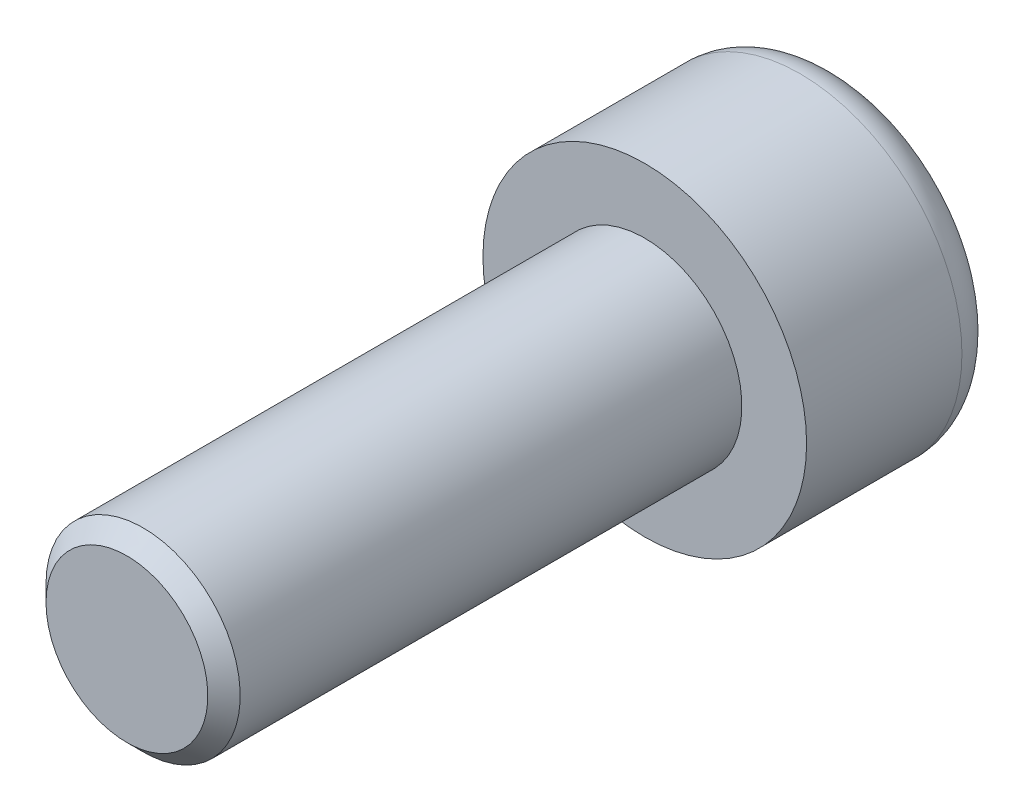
ISO-10303-21;
HEADER;
FILE_DESCRIPTION(('STEP AP214'),'2;1');
FILE_NAME('part.step','',(''),(''),'','','');
FILE_SCHEMA(('AUTOMOTIVE_DESIGN { 1 0 10303 214 1 1 1 1 }'));
ENDSEC;
DATA;
#1=APPLICATION_CONTEXT('core data for automotive mechanical design processes');
#2=APPLICATION_PROTOCOL_DEFINITION('international standard','automotive_design',2000,#1);
#3=PRODUCT_CONTEXT('',#1,'mechanical');
#4=PRODUCT('Part','Part','',(#3));
#5=PRODUCT_RELATED_PRODUCT_CATEGORY('part','',(#4));
#6=PRODUCT_DEFINITION_FORMATION('','',#4);
#7=PRODUCT_DEFINITION_CONTEXT('part definition',#1,'design');
#8=PRODUCT_DEFINITION('design','',#6,#7);
#9=PRODUCT_DEFINITION_SHAPE('','',#8);
#10=(LENGTH_UNIT() NAMED_UNIT(*) SI_UNIT(.MILLI.,.METRE.));
#11=(NAMED_UNIT(*) PLANE_ANGLE_UNIT() SI_UNIT($,.RADIAN.));
#12=(NAMED_UNIT(*) SI_UNIT($,.STERADIAN.) SOLID_ANGLE_UNIT());
#13=UNCERTAINTY_MEASURE_WITH_UNIT(LENGTH_MEASURE(1.E-05),#10,'distance_accuracy_value','');
#14=(GEOMETRIC_REPRESENTATION_CONTEXT(3) GLOBAL_UNCERTAINTY_ASSIGNED_CONTEXT((#13)) GLOBAL_UNIT_ASSIGNED_CONTEXT((#10,
#11,#12)) REPRESENTATION_CONTEXT('',''));
#15=CARTESIAN_POINT('',(0.,0.,0.));
#16=DIRECTION('',(0.,0.,1.));
#17=DIRECTION('',(1.,0.,0.));
#18=AXIS2_PLACEMENT_3D('',#15,#16,#17);
#19=CARTESIAN_POINT('',(-4.99999999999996,0.,3.75));
#20=DIRECTION('',(0.,0.,1.));
#21=DIRECTION('',(1.,0.,0.));
#22=AXIS2_PLACEMENT_3D('',#19,#20,#21);
#23=PLANE('',#22);
#24=DIRECTION('',(-0.866025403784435,0.500000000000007,0.));
#25=VECTOR('',#24,1.);
#26=CARTESIAN_POINT('',(0.,2.88675134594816,3.75));
#27=LINE('',#26,#25);
#28=CARTESIAN_POINT('',(0.,2.88675134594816,3.75));
#29=VERTEX_POINT('',#28);
#30=CARTESIAN_POINT('',(2.5,1.44337567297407,3.75));
#31=VERTEX_POINT('',#30);
#32=EDGE_CURVE('E65',#29,#31,#27,.F.);
#33=ORIENTED_EDGE('',*,*,#32,.T.);
#34=DIRECTION('',(0.,1.,0.));
#35=VECTOR('',#34,1.);
#36=CARTESIAN_POINT('',(2.5,1.44337567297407,3.75));
#37=LINE('',#36,#35);
#38=CARTESIAN_POINT('',(2.5,-1.44337567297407,3.75));
#39=VERTEX_POINT('',#38);
#40=EDGE_CURVE('E62',#31,#39,#37,.F.);
#41=ORIENTED_EDGE('',*,*,#40,.T.);
#42=DIRECTION('',(0.866025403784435,0.500000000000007,0.));
#43=VECTOR('',#42,1.);
#44=CARTESIAN_POINT('',(2.5,-1.44337567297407,3.75));
#45=LINE('',#44,#43);
#46=CARTESIAN_POINT('',(0.,-2.88675134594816,3.75));
#47=VERTEX_POINT('',#46);
#48=EDGE_CURVE('E59',#39,#47,#45,.F.);
#49=ORIENTED_EDGE('',*,*,#48,.T.);
#50=DIRECTION('',(0.866025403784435,-0.500000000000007,0.));
#51=VECTOR('',#50,1.);
#52=CARTESIAN_POINT('',(-2.5,-1.44337567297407,3.75));
#53=LINE('',#52,#51);
#54=CARTESIAN_POINT('',(-2.5,-1.44337567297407,3.75));
#55=VERTEX_POINT('',#54);
#56=EDGE_CURVE('E86',#47,#55,#53,.F.);
#57=ORIENTED_EDGE('',*,*,#56,.T.);
#58=DIRECTION('',(0.,1.,0.));
#59=VECTOR('',#58,1.);
#60=CARTESIAN_POINT('',(-2.5,1.44337567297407,3.75));
#61=LINE('',#60,#59);
#62=CARTESIAN_POINT('',(-2.5,1.44337567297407,3.75));
#63=VERTEX_POINT('',#62);
#64=EDGE_CURVE('E284',#55,#63,#61,.T.);
#65=ORIENTED_EDGE('',*,*,#64,.T.);
#66=DIRECTION('',(-0.866025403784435,-0.500000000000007,0.));
#67=VECTOR('',#66,1.);
#68=CARTESIAN_POINT('',(0.,2.88675134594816,3.75));
#69=LINE('',#68,#67);
#70=EDGE_CURVE('E291',#63,#29,#69,.F.);
#71=ORIENTED_EDGE('',*,*,#70,.T.);
#72=EDGE_LOOP('',(#33,#41,#49,#57,#65,#71));
#73=FACE_BOUND('',#72,.T.);
#74=ADVANCED_FACE('F16',(#73),#23,.F.);
#75=CARTESIAN_POINT('',(2.5,1.44337567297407,3.75));
#76=DIRECTION('',(1.,0.,0.));
#77=DIRECTION('',(0.,0.,-1.));
#78=AXIS2_PLACEMENT_3D('',#75,#76,#77);
#79=PLANE('',#78);
#80=DIRECTION('',(0.,0.,1.));
#81=VECTOR('',#80,1.);
#82=CARTESIAN_POINT('',(2.5,-1.44337567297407,3.75));
#83=LINE('',#82,#81);
#84=CARTESIAN_POINT('',(2.5,-1.44337567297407,0.));
#85=VERTEX_POINT('',#84);
#86=EDGE_CURVE('E69',#85,#39,#83,.T.);
#87=ORIENTED_EDGE('',*,*,#86,.T.);
#88=ORIENTED_EDGE('',*,*,#40,.F.);
#89=DIRECTION('',(0.,0.,1.));
#90=VECTOR('',#89,1.);
#91=CARTESIAN_POINT('',(2.5,1.44337567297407,3.75));
#92=LINE('',#91,#90);
#93=CARTESIAN_POINT('',(2.5,1.44337567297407,0.));
#94=VERTEX_POINT('',#93);
#95=EDGE_CURVE('E122',#31,#94,#92,.F.);
#96=ORIENTED_EDGE('',*,*,#95,.T.);
#97=DIRECTION('',(0.,1.,0.));
#98=VECTOR('',#97,1.);
#99=CARTESIAN_POINT('',(2.5,0.,0.));
#100=LINE('',#99,#98);
#101=EDGE_CURVE('E76',#94,#85,#100,.F.);
#102=ORIENTED_EDGE('',*,*,#101,.T.);
#103=EDGE_LOOP('',(#87,#88,#96,#102));
#104=FACE_BOUND('',#103,.T.);
#105=ADVANCED_FACE('F73',(#104),#79,.F.);
#106=CARTESIAN_POINT('',(2.5,-1.44337567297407,3.75));
#107=DIRECTION('',(0.500000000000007,-0.866025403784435,0.));
#108=DIRECTION('',(0.866025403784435,0.500000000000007,0.));
#109=AXIS2_PLACEMENT_3D('',#106,#107,#108);
#110=PLANE('',#109);
#111=DIRECTION('',(0.,0.,1.));
#112=VECTOR('',#111,1.);
#113=CARTESIAN_POINT('',(0.,-2.88675134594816,3.75));
#114=LINE('',#113,#112);
#115=CARTESIAN_POINT('',(0.,-2.88675134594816,0.));
#116=VERTEX_POINT('',#115);
#117=EDGE_CURVE('E83',#116,#47,#114,.T.);
#118=ORIENTED_EDGE('',*,*,#117,.T.);
#119=ORIENTED_EDGE('',*,*,#48,.F.);
#120=ORIENTED_EDGE('',*,*,#86,.F.);
#121=DIRECTION('',(-0.866025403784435,-0.500000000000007,0.));
#122=VECTOR('',#121,1.);
#123=CARTESIAN_POINT('',(2.5,-1.44337567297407,0.));
#124=LINE('',#123,#122);
#125=EDGE_CURVE('E120',#85,#116,#124,.T.);
#126=ORIENTED_EDGE('',*,*,#125,.T.);
#127=EDGE_LOOP('',(#118,#119,#120,#126));
#128=FACE_BOUND('',#127,.T.);
#129=ADVANCED_FACE('F81',(#128),#110,.F.);
#130=CARTESIAN_POINT('',(-2.5,-1.44337567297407,3.75));
#131=DIRECTION('',(-0.500000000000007,-0.866025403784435,0.));
#132=DIRECTION('',(0.866025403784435,-0.500000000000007,0.));
#133=AXIS2_PLACEMENT_3D('',#130,#131,#132);
#134=PLANE('',#133);
#135=DIRECTION('',(0.,0.,1.));
#136=VECTOR('',#135,1.);
#137=CARTESIAN_POINT('',(-2.5,-1.44337567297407,3.75));
#138=LINE('',#137,#136);
#139=CARTESIAN_POINT('',(-2.5,-1.44337567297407,0.));
#140=VERTEX_POINT('',#139);
#141=EDGE_CURVE('E279',#140,#55,#138,.T.);
#142=ORIENTED_EDGE('',*,*,#141,.T.);
#143=ORIENTED_EDGE('',*,*,#56,.F.);
#144=ORIENTED_EDGE('',*,*,#117,.F.);
#145=DIRECTION('',(-0.866025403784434,0.500000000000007,0.));
#146=VECTOR('',#145,1.);
#147=CARTESIAN_POINT('',(0.,-2.88675134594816,0.));
#148=LINE('',#147,#146);
#149=EDGE_CURVE('E117',#116,#140,#148,.T.);
#150=ORIENTED_EDGE('',*,*,#149,.T.);
#151=EDGE_LOOP('',(#142,#143,#144,#150));
#152=FACE_BOUND('',#151,.T.);
#153=ADVANCED_FACE('F234',(#152),#134,.F.);
#154=CARTESIAN_POINT('',(-2.5,1.44337567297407,3.75));
#155=DIRECTION('',(-1.,0.,0.));
#156=DIRECTION('',(0.,0.,1.));
#157=AXIS2_PLACEMENT_3D('',#154,#155,#156);
#158=PLANE('',#157);
#159=DIRECTION('',(0.,0.,1.));
#160=VECTOR('',#159,1.);
#161=CARTESIAN_POINT('',(-2.5,1.44337567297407,3.75));
#162=LINE('',#161,#160);
#163=CARTESIAN_POINT('',(-2.5,1.44337567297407,0.));
#164=VERTEX_POINT('',#163);
#165=EDGE_CURVE('E288',#164,#63,#162,.T.);
#166=ORIENTED_EDGE('',*,*,#165,.T.);
#167=ORIENTED_EDGE('',*,*,#64,.F.);
#168=ORIENTED_EDGE('',*,*,#141,.F.);
#169=DIRECTION('',(0.,1.,0.));
#170=VECTOR('',#169,1.);
#171=CARTESIAN_POINT('',(-2.5,0.,0.));
#172=LINE('',#171,#170);
#173=EDGE_CURVE('E108',#140,#164,#172,.T.);
#174=ORIENTED_EDGE('',*,*,#173,.T.);
#175=EDGE_LOOP('',(#166,#167,#168,#174));
#176=FACE_BOUND('',#175,.T.);
#177=ADVANCED_FACE('F224',(#176),#158,.F.);
#178=CARTESIAN_POINT('',(0.,2.88675134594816,3.75));
#179=DIRECTION('',(-0.500000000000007,0.866025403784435,0.));
#180=DIRECTION('',(-0.866025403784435,-0.500000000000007,0.));
#181=AXIS2_PLACEMENT_3D('',#178,#179,#180);
#182=PLANE('',#181);
#183=DIRECTION('',(0.,0.,1.));
#184=VECTOR('',#183,1.);
#185=CARTESIAN_POINT('',(0.,2.88675134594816,3.75));
#186=LINE('',#185,#184);
#187=CARTESIAN_POINT('',(0.,2.88675134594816,0.));
#188=VERTEX_POINT('',#187);
#189=EDGE_CURVE('E295',#188,#29,#186,.T.);
#190=ORIENTED_EDGE('',*,*,#189,.T.);
#191=ORIENTED_EDGE('',*,*,#70,.F.);
#192=ORIENTED_EDGE('',*,*,#165,.F.);
#193=DIRECTION('',(0.866025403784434,0.500000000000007,0.));
#194=VECTOR('',#193,1.);
#195=CARTESIAN_POINT('',(-2.5,1.44337567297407,0.));
#196=LINE('',#195,#194);
#197=EDGE_CURVE('E102',#164,#188,#196,.T.);
#198=ORIENTED_EDGE('',*,*,#197,.T.);
#199=EDGE_LOOP('',(#190,#191,#192,#198));
#200=FACE_BOUND('',#199,.T.);
#201=ADVANCED_FACE('F163',(#200),#182,.F.);
#202=CARTESIAN_POINT('',(0.,2.88675134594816,3.75));
#203=DIRECTION('',(0.500000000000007,0.866025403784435,0.));
#204=DIRECTION('',(-0.866025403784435,0.500000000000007,0.));
#205=AXIS2_PLACEMENT_3D('',#202,#203,#204);
#206=PLANE('',#205);
#207=ORIENTED_EDGE('',*,*,#95,.F.);
#208=ORIENTED_EDGE('',*,*,#32,.F.);
#209=ORIENTED_EDGE('',*,*,#189,.F.);
#210=DIRECTION('',(0.866025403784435,-0.500000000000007,0.));
#211=VECTOR('',#210,1.);
#212=CARTESIAN_POINT('',(0.,2.88675134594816,0.));
#213=LINE('',#212,#211);
#214=EDGE_CURVE('E100',#188,#94,#213,.T.);
#215=ORIENTED_EDGE('',*,*,#214,.T.);
#216=EDGE_LOOP('',(#207,#208,#209,#215));
#217=FACE_BOUND('',#216,.T.);
#218=ADVANCED_FACE('F157',(#217),#206,.F.);
#219=CARTESIAN_POINT('',(0.,0.,0.));
#220=DIRECTION('',(0.,0.,1.));
#221=DIRECTION('',(1.,0.,0.));
#222=AXIS2_PLACEMENT_3D('',#219,#220,#221);
#223=PLANE('',#222);
#224=ORIENTED_EDGE('',*,*,#197,.F.);
#225=ORIENTED_EDGE('',*,*,#173,.F.);
#226=ORIENTED_EDGE('',*,*,#149,.F.);
#227=ORIENTED_EDGE('',*,*,#125,.F.);
#228=ORIENTED_EDGE('',*,*,#101,.F.);
#229=ORIENTED_EDGE('',*,*,#214,.F.);
#230=EDGE_LOOP('',(#224,#225,#226,#227,#228,#229));
#231=FACE_BOUND('',#230,.T.);
#232=CARTESIAN_POINT('',(0.,0.,0.));
#233=DIRECTION('',(0.,0.,1.));
#234=DIRECTION('',(1.,0.,0.));
#235=AXIS2_PLACEMENT_3D('',#232,#233,#234);
#236=CIRCLE('',#235,3.8);
#237=CARTESIAN_POINT('',(3.8,0.,0.));
#238=VERTEX_POINT('',#237);
#239=CARTESIAN_POINT('',(-3.8,0.,0.));
#240=VERTEX_POINT('',#239);
#241=EDGE_CURVE('E98',#238,#240,#236,.T.);
#242=ORIENTED_EDGE('',*,*,#241,.F.);
#243=CARTESIAN_POINT('',(0.,0.,0.));
#244=DIRECTION('',(0.,0.,1.));
#245=DIRECTION('',(-1.,0.,0.));
#246=AXIS2_PLACEMENT_3D('',#243,#244,#245);
#247=CIRCLE('',#246,3.8);
#248=EDGE_CURVE('E35',#240,#238,#247,.T.);
#249=ORIENTED_EDGE('',*,*,#248,.F.);
#250=EDGE_LOOP('',(#242,#249));
#251=FACE_BOUND('',#250,.T.);
#252=ADVANCED_FACE('F138',(#231,#251),#223,.F.);
#253=CARTESIAN_POINT('',(0.,0.,1.2));
#254=DIRECTION('',(0.,0.,1.));
#255=DIRECTION('',(1.,0.,0.));
#256=AXIS2_PLACEMENT_3D('',#253,#254,#255);
#257=TOROIDAL_SURFACE('',#256,3.8,1.2);
#258=CARTESIAN_POINT('',(0.,0.,1.2));
#259=DIRECTION('',(0.,0.,-1.));
#260=DIRECTION('',(-1.,0.,0.));
#261=AXIS2_PLACEMENT_3D('',#258,#259,#260);
#262=CIRCLE('',#261,5.);
#263=CARTESIAN_POINT('',(-5.,0.,1.2));
#264=VERTEX_POINT('',#263);
#265=EDGE_CURVE('E95',#264,#264,#262,.F.);
#266=ORIENTED_EDGE('',*,*,#265,.F.);
#267=EDGE_LOOP('',(#266));
#268=FACE_BOUND('',#267,.T.);
#269=ORIENTED_EDGE('',*,*,#241,.T.);
#270=ORIENTED_EDGE('',*,*,#248,.T.);
#271=EDGE_LOOP('',(#269,#270));
#272=FACE_BOUND('',#271,.T.);
#273=ADVANCED_FACE('F97',(#268,#272),#257,.T.);
#274=CARTESIAN_POINT('',(0.,0.,22.));
#275=DIRECTION('',(0.,0.,1.));
#276=DIRECTION('',(1.,0.,0.));
#277=AXIS2_PLACEMENT_3D('',#274,#275,#276);
#278=PLANE('',#277);
#279=CARTESIAN_POINT('',(0.,0.,22.0000000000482));
#280=DIRECTION('',(0.,0.,-1.));
#281=DIRECTION('',(-1.,0.,0.));
#282=AXIS2_PLACEMENT_3D('',#279,#280,#281);
#283=CIRCLE('',#282,2.49999999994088);
#284=CARTESIAN_POINT('',(-2.49999999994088,0.,22.0000000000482));
#285=VERTEX_POINT('',#284);
#286=EDGE_CURVE('E93',#285,#285,#283,.T.);
#287=ORIENTED_EDGE('',*,*,#286,.F.);
#288=EDGE_LOOP('',(#287));
#289=FACE_BOUND('',#288,.T.);
#290=ADVANCED_FACE('F137',(#289),#278,.T.);
#291=CARTESIAN_POINT('',(0.,0.,6.));
#292=DIRECTION('',(0.,0.,-1.));
#293=DIRECTION('',(-1.,0.,0.));
#294=AXIS2_PLACEMENT_3D('',#291,#292,#293);
#295=CYLINDRICAL_SURFACE('',#294,5.);
#296=ORIENTED_EDGE('',*,*,#265,.T.);
#297=EDGE_LOOP('',(#296));
#298=FACE_BOUND('',#297,.T.);
#299=CARTESIAN_POINT('',(0.,0.,6.));
#300=DIRECTION('',(0.,0.,-1.));
#301=DIRECTION('',(-1.,0.,0.));
#302=AXIS2_PLACEMENT_3D('',#299,#300,#301);
#303=CIRCLE('',#302,5.);
#304=CARTESIAN_POINT('',(-5.,0.,6.));
#305=VERTEX_POINT('',#304);
#306=EDGE_CURVE('E90',#305,#305,#303,.F.);
#307=ORIENTED_EDGE('',*,*,#306,.F.);
#308=EDGE_LOOP('',(#307));
#309=FACE_BOUND('',#308,.T.);
#310=ADVANCED_FACE('F179',(#298,#309),#295,.T.);
#311=CARTESIAN_POINT('',(0.,0.,21.50000000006));
#312=DIRECTION('',(0.,0.,-1.));
#313=DIRECTION('',(-1.,0.,0.));
#314=AXIS2_PLACEMENT_3D('',#311,#312,#313);
#315=CONICAL_SURFACE('',#314,2.9999999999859,0.785398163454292);
#316=CARTESIAN_POINT('',(0.,0.,21.5));
#317=DIRECTION('',(0.,0.,-1.));
#318=DIRECTION('',(-1.,0.,0.));
#319=AXIS2_PLACEMENT_3D('',#316,#317,#318);
#320=CIRCLE('',#319,3.);
#321=CARTESIAN_POINT('',(-3.,0.,21.5));
#322=VERTEX_POINT('',#321);
#323=EDGE_CURVE('E27',#322,#322,#320,.T.);
#324=ORIENTED_EDGE('',*,*,#323,.F.);
#325=EDGE_LOOP('',(#324));
#326=FACE_BOUND('',#325,.T.);
#327=ORIENTED_EDGE('',*,*,#286,.T.);
#328=EDGE_LOOP('',(#327));
#329=FACE_BOUND('',#328,.T.);
#330=ADVANCED_FACE('F173',(#326,#329),#315,.T.);
#331=CARTESIAN_POINT('',(0.,0.,6.));
#332=DIRECTION('',(0.,0.,1.));
#333=DIRECTION('',(1.,0.,0.));
#334=AXIS2_PLACEMENT_3D('',#331,#332,#333);
#335=PLANE('',#334);
#336=CARTESIAN_POINT('',(0.,0.,6.));
#337=DIRECTION('',(0.,0.,-1.));
#338=DIRECTION('',(-1.,0.,0.));
#339=AXIS2_PLACEMENT_3D('',#336,#337,#338);
#340=CIRCLE('',#339,3.);
#341=CARTESIAN_POINT('',(-3.,0.,6.));
#342=VERTEX_POINT('',#341);
#343=EDGE_CURVE('E11',#342,#342,#340,.F.);
#344=ORIENTED_EDGE('',*,*,#343,.F.);
#345=EDGE_LOOP('',(#344));
#346=FACE_BOUND('',#345,.T.);
#347=ORIENTED_EDGE('',*,*,#306,.T.);
#348=EDGE_LOOP('',(#347));
#349=FACE_BOUND('',#348,.T.);
#350=ADVANCED_FACE('F167',(#346,#349),#335,.T.);
#351=CARTESIAN_POINT('',(0.,0.,22.));
#352=DIRECTION('',(0.,0.,-1.));
#353=DIRECTION('',(-1.,0.,0.));
#354=AXIS2_PLACEMENT_3D('',#351,#352,#353);
#355=CYLINDRICAL_SURFACE('',#354,3.);
#356=ORIENTED_EDGE('',*,*,#343,.T.);
#357=EDGE_LOOP('',(#356));
#358=FACE_BOUND('',#357,.T.);
#359=ORIENTED_EDGE('',*,*,#323,.T.);
#360=EDGE_LOOP('',(#359));
#361=FACE_BOUND('',#360,.T.);
#362=ADVANCED_FACE('F165',(#358,#361),#355,.T.);
#363=CLOSED_SHELL('',(#74,#105,#129,#153,#177,#201,#218,#252,#273,#290,#310,#330,#350,#362));
#364=MANIFOLD_SOLID_BREP('B1',#363);
#365=ADVANCED_BREP_SHAPE_REPRESENTATION('',(#18,#364),#14);
#366=SHAPE_DEFINITION_REPRESENTATION(#9,#365);
ENDSEC;
END-ISO-10303-21;
